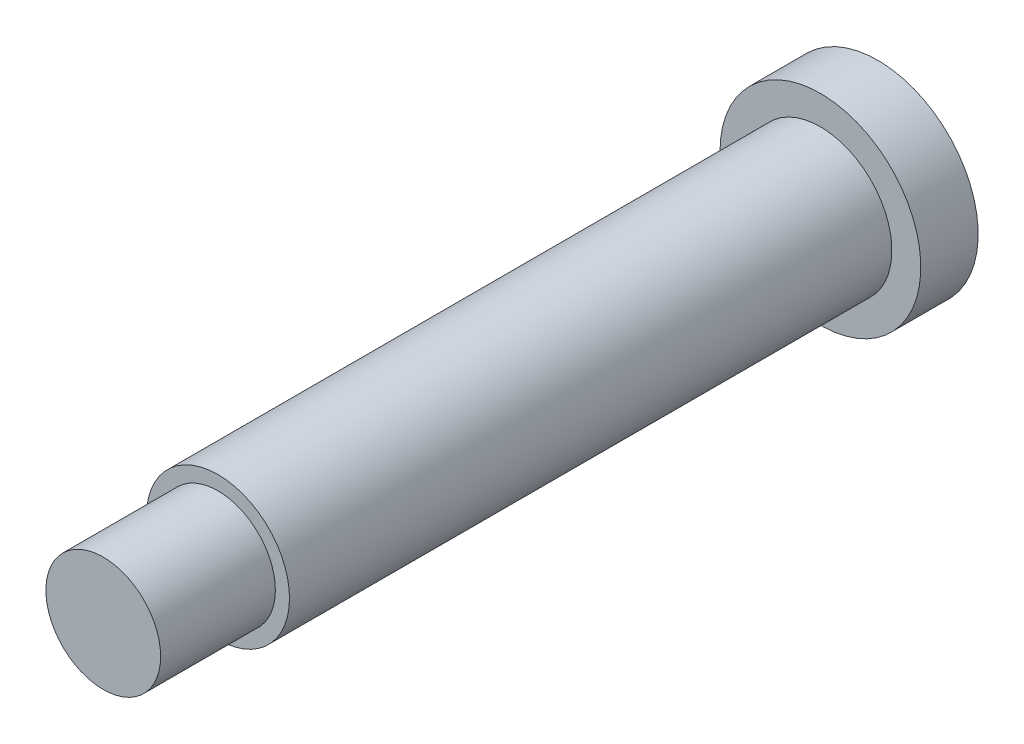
ISO-10303-21;
HEADER;
FILE_DESCRIPTION(('STEP AP214'),'2;1');
FILE_NAME('part.step','',(''),(''),'','','');
FILE_SCHEMA(('AUTOMOTIVE_DESIGN { 1 0 10303 214 1 1 1 1 }'));
ENDSEC;
DATA;
#1=APPLICATION_CONTEXT('core data for automotive mechanical design processes');
#2=APPLICATION_PROTOCOL_DEFINITION('international standard','automotive_design',2000,#1);
#3=PRODUCT_CONTEXT('',#1,'mechanical');
#4=PRODUCT('Part','Part','',(#3));
#5=PRODUCT_RELATED_PRODUCT_CATEGORY('part','',(#4));
#6=PRODUCT_DEFINITION_FORMATION('','',#4);
#7=PRODUCT_DEFINITION_CONTEXT('part definition',#1,'design');
#8=PRODUCT_DEFINITION('design','',#6,#7);
#9=PRODUCT_DEFINITION_SHAPE('','',#8);
#10=(LENGTH_UNIT() NAMED_UNIT(*) SI_UNIT(.MILLI.,.METRE.));
#11=(NAMED_UNIT(*) PLANE_ANGLE_UNIT() SI_UNIT($,.RADIAN.));
#12=(NAMED_UNIT(*) SI_UNIT($,.STERADIAN.) SOLID_ANGLE_UNIT());
#13=UNCERTAINTY_MEASURE_WITH_UNIT(LENGTH_MEASURE(1.E-05),#10,'distance_accuracy_value','');
#14=(GEOMETRIC_REPRESENTATION_CONTEXT(3) GLOBAL_UNCERTAINTY_ASSIGNED_CONTEXT((#13)) GLOBAL_UNIT_ASSIGNED_CONTEXT((#10,
#11,#12)) REPRESENTATION_CONTEXT('',''));
#15=CARTESIAN_POINT('',(0.,0.,0.));
#16=DIRECTION('',(0.,0.,1.));
#17=DIRECTION('',(1.,0.,0.));
#18=AXIS2_PLACEMENT_3D('',#15,#16,#17);
#19=CARTESIAN_POINT('',(0.,0.,66.675));
#20=DIRECTION('',(0.,0.,1.));
#21=DIRECTION('',(1.,0.,0.));
#22=AXIS2_PLACEMENT_3D('',#19,#20,#21);
#23=PLANE('',#22);
#24=CARTESIAN_POINT('',(0.,0.,66.675));
#25=DIRECTION('',(0.,0.,1.));
#26=DIRECTION('',(1.,0.,0.));
#27=AXIS2_PLACEMENT_3D('',#24,#25,#26);
#28=CIRCLE('',#27,7.9121);
#29=CARTESIAN_POINT('',(7.9121,0.,66.675));
#30=VERTEX_POINT('',#29);
#31=EDGE_CURVE('E10',#30,#30,#28,.T.);
#32=ORIENTED_EDGE('',*,*,#31,.T.);
#33=EDGE_LOOP('',(#32));
#34=FACE_BOUND('',#33,.T.);
#35=CARTESIAN_POINT('',(0.,0.,66.675));
#36=DIRECTION('',(0.,0.,1.));
#37=DIRECTION('',(1.,0.,0.));
#38=AXIS2_PLACEMENT_3D('',#35,#36,#37);
#39=CIRCLE('',#38,6.35);
#40=CARTESIAN_POINT('',(6.35,0.,66.675));
#41=VERTEX_POINT('',#40);
#42=EDGE_CURVE('E37',#41,#41,#39,.T.);
#43=ORIENTED_EDGE('',*,*,#42,.F.);
#44=EDGE_LOOP('',(#43));
#45=FACE_BOUND('',#44,.T.);
#46=ADVANCED_FACE('F26',(#34,#45),#23,.T.);
#47=CARTESIAN_POINT('',(0.,0.,66.675));
#48=DIRECTION('',(0.,0.,-1.));
#49=DIRECTION('',(-1.,0.,0.));
#50=AXIS2_PLACEMENT_3D('',#47,#48,#49);
#51=CYLINDRICAL_SURFACE('',#50,7.9121);
#52=ORIENTED_EDGE('',*,*,#31,.F.);
#53=EDGE_LOOP('',(#52));
#54=FACE_BOUND('',#53,.T.);
#55=CARTESIAN_POINT('',(0.,0.,0.));
#56=DIRECTION('',(0.,0.,-1.));
#57=DIRECTION('',(-1.,0.,0.));
#58=AXIS2_PLACEMENT_3D('',#55,#56,#57);
#59=CIRCLE('',#58,7.9121);
#60=CARTESIAN_POINT('',(-7.9121,0.,0.));
#61=VERTEX_POINT('',#60);
#62=EDGE_CURVE('E41',#61,#61,#59,.T.);
#63=ORIENTED_EDGE('',*,*,#62,.F.);
#64=EDGE_LOOP('',(#63));
#65=FACE_BOUND('',#64,.T.);
#66=ADVANCED_FACE('F28',(#54,#65),#51,.T.);
#67=CARTESIAN_POINT('',(0.,0.,79.375));
#68=DIRECTION('',(0.,0.,-1.));
#69=DIRECTION('',(-1.,0.,0.));
#70=AXIS2_PLACEMENT_3D('',#67,#68,#69);
#71=CYLINDRICAL_SURFACE('',#70,6.35);
#72=CARTESIAN_POINT('',(0.,0.,79.375));
#73=DIRECTION('',(0.,0.,1.));
#74=DIRECTION('',(1.,0.,0.));
#75=AXIS2_PLACEMENT_3D('',#72,#73,#74);
#76=CIRCLE('',#75,6.35);
#77=CARTESIAN_POINT('',(6.35,0.,79.375));
#78=VERTEX_POINT('',#77);
#79=EDGE_CURVE('E33',#78,#78,#76,.T.);
#80=ORIENTED_EDGE('',*,*,#79,.F.);
#81=EDGE_LOOP('',(#80));
#82=FACE_BOUND('',#81,.T.);
#83=ORIENTED_EDGE('',*,*,#42,.T.);
#84=EDGE_LOOP('',(#83));
#85=FACE_BOUND('',#84,.T.);
#86=ADVANCED_FACE('F63',(#82,#85),#71,.T.);
#87=CARTESIAN_POINT('',(0.,0.,79.375));
#88=DIRECTION('',(0.,0.,1.));
#89=DIRECTION('',(1.,0.,0.));
#90=AXIS2_PLACEMENT_3D('',#87,#88,#89);
#91=PLANE('',#90);
#92=ORIENTED_EDGE('',*,*,#79,.T.);
#93=EDGE_LOOP('',(#92));
#94=FACE_BOUND('',#93,.T.);
#95=ADVANCED_FACE('F58',(#94),#91,.T.);
#96=CARTESIAN_POINT('',(0.,0.,0.));
#97=DIRECTION('',(0.,0.,-1.));
#98=DIRECTION('',(-1.,0.,0.));
#99=AXIS2_PLACEMENT_3D('',#96,#97,#98);
#100=PLANE('',#99);
#101=CARTESIAN_POINT('',(0.,0.,0.));
#102=DIRECTION('',(0.,0.,-1.));
#103=DIRECTION('',(-1.,0.,0.));
#104=AXIS2_PLACEMENT_3D('',#101,#102,#103);
#105=CIRCLE('',#104,11.1125);
#106=CARTESIAN_POINT('',(-11.1125,0.,0.));
#107=VERTEX_POINT('',#106);
#108=EDGE_CURVE('E49',#107,#107,#105,.T.);
#109=ORIENTED_EDGE('',*,*,#108,.F.);
#110=EDGE_LOOP('',(#109));
#111=FACE_BOUND('',#110,.T.);
#112=ORIENTED_EDGE('',*,*,#62,.T.);
#113=EDGE_LOOP('',(#112));
#114=FACE_BOUND('',#113,.T.);
#115=ADVANCED_FACE('F55',(#111,#114),#100,.F.);
#116=CARTESIAN_POINT('',(0.,0.,-6.35));
#117=DIRECTION('',(0.,0.,1.));
#118=DIRECTION('',(1.,0.,0.));
#119=AXIS2_PLACEMENT_3D('',#116,#117,#118);
#120=CYLINDRICAL_SURFACE('',#119,11.1125);
#121=CARTESIAN_POINT('',(0.,0.,-6.35));
#122=DIRECTION('',(0.,0.,-1.));
#123=DIRECTION('',(-1.,0.,0.));
#124=AXIS2_PLACEMENT_3D('',#121,#122,#123);
#125=CIRCLE('',#124,11.1125);
#126=CARTESIAN_POINT('',(-11.1125,0.,-6.35));
#127=VERTEX_POINT('',#126);
#128=EDGE_CURVE('E46',#127,#127,#125,.T.);
#129=ORIENTED_EDGE('',*,*,#128,.F.);
#130=EDGE_LOOP('',(#129));
#131=FACE_BOUND('',#130,.T.);
#132=ORIENTED_EDGE('',*,*,#108,.T.);
#133=EDGE_LOOP('',(#132));
#134=FACE_BOUND('',#133,.T.);
#135=ADVANCED_FACE('F53',(#131,#134),#120,.T.);
#136=CARTESIAN_POINT('',(0.,0.,-6.35));
#137=DIRECTION('',(0.,0.,-1.));
#138=DIRECTION('',(-1.,0.,0.));
#139=AXIS2_PLACEMENT_3D('',#136,#137,#138);
#140=PLANE('',#139);
#141=ORIENTED_EDGE('',*,*,#128,.T.);
#142=EDGE_LOOP('',(#141));
#143=FACE_BOUND('',#142,.T.);
#144=ADVANCED_FACE('F79',(#143),#140,.T.);
#145=CLOSED_SHELL('',(#46,#66,#86,#95,#115,#135,#144));
#146=MANIFOLD_SOLID_BREP('B2',#145);
#147=ADVANCED_BREP_SHAPE_REPRESENTATION('',(#18,#146),#14);
#148=SHAPE_DEFINITION_REPRESENTATION(#9,#147);
ENDSEC;
END-ISO-10303-21;
